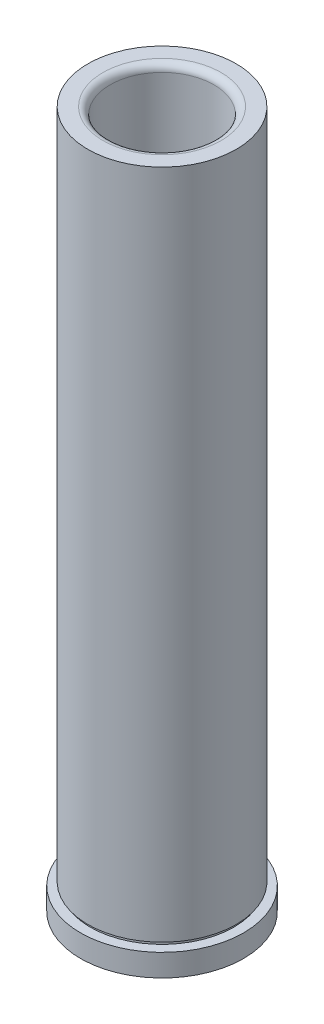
from build123d import *

# Parameters (mm, degrees)
FILLET1_R = 1.524


with BuildPart() as part:
    # Sketch1 → Revolve1 (revolve)
    with BuildSketch(Plane.XY, mode=Mode.PRIVATE) as revolve1_sk:
        with BuildLine():
            Line((-11.11885, 149.225), (-11.11885, 104.775))
            ThreePointArc((-11.11885, 104.775), (-12.016875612, 104.403025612), (-12.38885, 103.505))
            Line((-12.38885, 103.505), (-12.38885, 0.79375))
            Line((-12.38885, 0.79375), (-13.1826, 0))
            Line((-13.1826, 0), (-17.4625, 0))
            Line((-17.4625, 0), (-17.4625, 4.7625))
            Line((-17.4625, 4.7625), (-15.37335, 4.7625))
            Line((-15.37335, 4.7625), (-15.37335, 5.5245))
            Line((-15.37335, 5.5245), (-15.88135, 5.5245))
            Line((-15.88135, 5.5245), (-15.88135, 149.225))
            Line((-15.88135, 149.225), (-11.11885, 149.225))
        make_face()
    revolve(revolve1_sk.sketch.rotate(Axis((0, -1000, 0), (0, 1, 0)), 180), axis=Axis((0, -1000, 0), (0, 1, 0)))

    # Fillet1
    fillet1_edges = [part.edges().sort_by_distance(p)[0] for p in [
        (-11.11885, 149.225, 0),
    ]]
    fillet(fillet1_edges, radius=FILLET1_R)


solid = part.part
